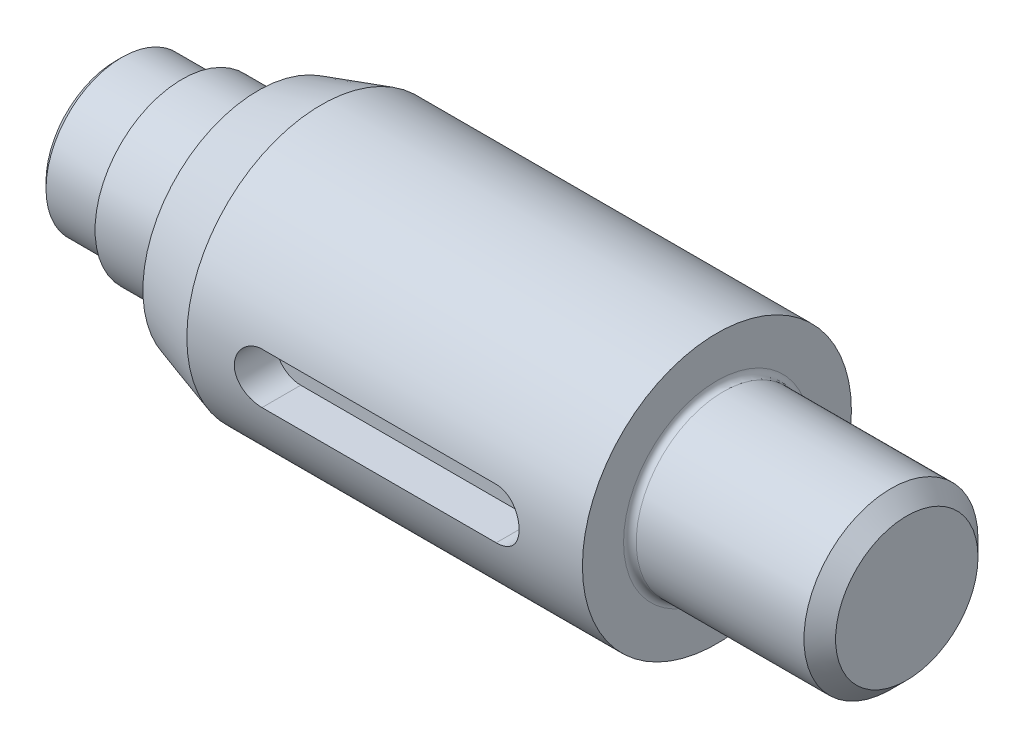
ISO-10303-21;
HEADER;
FILE_DESCRIPTION(('STEP AP214'),'2;1');
FILE_NAME('part.step','',(''),(''),'','','');
FILE_SCHEMA(('AUTOMOTIVE_DESIGN { 1 0 10303 214 1 1 1 1 }'));
ENDSEC;
DATA;
#1=APPLICATION_CONTEXT('core data for automotive mechanical design processes');
#2=APPLICATION_PROTOCOL_DEFINITION('international standard','automotive_design',2000,#1);
#3=PRODUCT_CONTEXT('',#1,'mechanical');
#4=PRODUCT('Part','Part','',(#3));
#5=PRODUCT_RELATED_PRODUCT_CATEGORY('part','',(#4));
#6=PRODUCT_DEFINITION_FORMATION('','',#4);
#7=PRODUCT_DEFINITION_CONTEXT('part definition',#1,'design');
#8=PRODUCT_DEFINITION('design','',#6,#7);
#9=PRODUCT_DEFINITION_SHAPE('','',#8);
#10=(LENGTH_UNIT() NAMED_UNIT(*) SI_UNIT(.MILLI.,.METRE.));
#11=(NAMED_UNIT(*) PLANE_ANGLE_UNIT() SI_UNIT($,.RADIAN.));
#12=(NAMED_UNIT(*) SI_UNIT($,.STERADIAN.) SOLID_ANGLE_UNIT());
#13=UNCERTAINTY_MEASURE_WITH_UNIT(LENGTH_MEASURE(1.E-05),#10,'distance_accuracy_value','');
#14=(GEOMETRIC_REPRESENTATION_CONTEXT(3) GLOBAL_UNCERTAINTY_ASSIGNED_CONTEXT((#13)) GLOBAL_UNIT_ASSIGNED_CONTEXT((#10,
#11,#12)) REPRESENTATION_CONTEXT('',''));
#15=CARTESIAN_POINT('',(0.,0.,0.));
#16=DIRECTION('',(0.,0.,1.));
#17=DIRECTION('',(1.,0.,0.));
#18=AXIS2_PLACEMENT_3D('',#15,#16,#17);
#19=CARTESIAN_POINT('',(0.,0.,0.));
#20=DIRECTION('',(1.,0.,0.));
#21=DIRECTION('',(0.,0.,-1.));
#22=AXIS2_PLACEMENT_3D('',#19,#20,#21);
#23=CYLINDRICAL_SURFACE('',#22,42.5);
#24=CARTESIAN_POINT('',(65.,0.,0.));
#25=DIRECTION('',(1.,0.,0.));
#26=DIRECTION('',(0.,0.,-1.));
#27=AXIS2_PLACEMENT_3D('',#24,#25,#26);
#28=CIRCLE('',#27,42.5);
#29=CARTESIAN_POINT('',(65.,0.,-42.5));
#30=VERTEX_POINT('',#29);
#31=EDGE_CURVE('E120',#30,#30,#28,.T.);
#32=ORIENTED_EDGE('',*,*,#31,.T.);
#33=EDGE_LOOP('',(#32));
#34=FACE_BOUND('',#33,.T.);
#35=CARTESIAN_POINT('',(190.,0.,0.));
#36=DIRECTION('',(1.,0.,0.));
#37=DIRECTION('',(0.,0.,-1.));
#38=AXIS2_PLACEMENT_3D('',#35,#36,#37);
#39=CIRCLE('',#38,42.5);
#40=CARTESIAN_POINT('',(190.,0.,-42.5));
#41=VERTEX_POINT('',#40);
#42=EDGE_CURVE('E94',#41,#41,#39,.T.);
#43=ORIENTED_EDGE('',*,*,#42,.F.);
#44=EDGE_LOOP('',(#43));
#45=FACE_BOUND('',#44,.T.);
#46=DIRECTION('',(1.,0.,0.));
#47=VECTOR('',#46,1.);
#48=CARTESIAN_POINT('',(0.,8.,41.7402683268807));
#49=LINE('',#48,#47);
#50=CARTESIAN_POINT('',(88.,8.,41.7402683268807));
#51=VERTEX_POINT('',#50);
#52=CARTESIAN_POINT('',(162.,8.,41.7402683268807));
#53=VERTEX_POINT('',#52);
#54=EDGE_CURVE('E167',#51,#53,#49,.T.);
#55=ORIENTED_EDGE('',*,*,#54,.T.);
#56=CARTESIAN_POINT('',(162.,8.,41.7402683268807));
#57=CARTESIAN_POINT('',(162.222876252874,8.00002638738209,41.7402496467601));
#58=CARTESIAN_POINT('',(162.445746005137,7.99068730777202,41.7420527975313));
#59=CARTESIAN_POINT('',(162.889851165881,7.95347087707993,41.7491672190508));
#60=CARTESIAN_POINT('',(163.111086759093,7.9255956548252,41.7544780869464));
#61=CARTESIAN_POINT('',(163.55004074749,7.85155238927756,41.7684624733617));
#62=CARTESIAN_POINT('',(163.767763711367,7.80541050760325,41.7771311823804));
#63=CARTESIAN_POINT('',(164.198473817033,7.69520108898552,41.7975721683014));
#64=CARTESIAN_POINT('',(164.411460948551,7.6311335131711,41.8093444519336));
#65=CARTESIAN_POINT('',(164.831200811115,7.48556247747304,41.8356524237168));
#66=CARTESIAN_POINT('',(165.037953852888,7.40405988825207,41.8501879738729));
#67=CARTESIAN_POINT('',(165.443892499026,7.22418907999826,41.8816120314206));
#68=CARTESIAN_POINT('',(165.643075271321,7.12581462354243,41.898501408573));
#69=CARTESIAN_POINT('',(166.032386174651,6.9129635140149,41.934145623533));
#70=CARTESIAN_POINT('',(166.222517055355,6.79849179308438,41.9528998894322));
#71=CARTESIAN_POINT('',(166.592585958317,6.55418430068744,41.9917606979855));
#72=CARTESIAN_POINT('',(166.772520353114,6.42434311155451,42.0118677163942));
#73=CARTESIAN_POINT('',(167.122841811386,6.14871592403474,42.053096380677));
#74=CARTESIAN_POINT('',(167.293102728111,6.00277087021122,42.0742267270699));
#75=CARTESIAN_POINT('',(167.620763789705,5.69712304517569,42.1167020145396));
#76=CARTESIAN_POINT('',(167.7781638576,5.53742019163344,42.1380469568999));
#77=CARTESIAN_POINT('',(168.079078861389,5.2052887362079,42.1803626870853));
#78=CARTESIAN_POINT('',(168.22258937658,5.03285611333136,42.2013333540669));
#79=CARTESIAN_POINT('',(168.494632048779,4.67653517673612,42.2423030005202));
#80=CARTESIAN_POINT('',(168.623169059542,4.49265060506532,42.2623022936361));
#81=CARTESIAN_POINT('',(168.865361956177,4.11313431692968,42.3009312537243));
#82=CARTESIAN_POINT('',(168.978892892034,3.91742160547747,42.3195489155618));
#83=CARTESIAN_POINT('',(169.189038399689,3.51693935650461,42.3547109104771));
#84=CARTESIAN_POINT('',(169.285653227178,3.31216995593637,42.3712552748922));
#85=CARTESIAN_POINT('',(169.461230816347,2.89503642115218,42.4017981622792));
#86=CARTESIAN_POINT('',(169.540195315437,2.6826730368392,42.4157969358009));
#87=CARTESIAN_POINT('',(169.679869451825,2.25186123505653,42.440849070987));
#88=CARTESIAN_POINT('',(169.740579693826,2.03341301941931,42.4519025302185));
#89=CARTESIAN_POINT('',(169.842675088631,1.59455847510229,42.470637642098));
#90=CARTESIAN_POINT('',(169.884274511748,1.37420357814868,42.4783566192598));
#91=CARTESIAN_POINT('',(169.948826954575,0.930768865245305,42.4903852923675));
#92=CARTESIAN_POINT('',(169.971786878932,0.707690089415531,42.4946962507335));
#93=CARTESIAN_POINT('',(169.998903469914,0.260323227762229,42.4997915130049));
#94=CARTESIAN_POINT('',(170.00305769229,0.0360349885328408,42.5005753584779));
#95=CARTESIAN_POINT('',(169.992522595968,-0.412081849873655,42.4985928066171));
#96=CARTESIAN_POINT('',(169.977833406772,-0.635910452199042,42.4958264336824));
#97=CARTESIAN_POINT('',(169.930039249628,-1.07861448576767,42.4868801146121));
#98=CARTESIAN_POINT('',(169.897172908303,-1.29751662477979,42.4807444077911));
#99=CARTESIAN_POINT('',(169.813434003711,-1.73181175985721,42.4652570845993));
#100=CARTESIAN_POINT('',(169.762555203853,-1.94720351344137,42.4559043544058));
#101=CARTESIAN_POINT('',(169.64319283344,-2.37285752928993,42.4342427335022));
#102=CARTESIAN_POINT('',(169.574712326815,-2.58312067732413,42.4219343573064));
#103=CARTESIAN_POINT('',(169.420651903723,-2.99711691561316,42.3946969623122));
#104=CARTESIAN_POINT('',(169.335071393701,-3.20084977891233,42.3797678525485));
#105=CARTESIAN_POINT('',(169.146903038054,-3.60153348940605,42.347604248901));
#106=CARTESIAN_POINT('',(169.044221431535,-3.79843928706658,42.3303571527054));
#107=CARTESIAN_POINT('',(168.822932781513,-4.18291611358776,42.2940953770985));
#108=CARTESIAN_POINT('',(168.704325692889,-4.37048711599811,42.2750806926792));
#109=CARTESIAN_POINT('',(168.452006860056,-4.73505590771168,42.2358007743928));
#110=CARTESIAN_POINT('',(168.318294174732,-4.91205303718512,42.2155354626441));
#111=CARTESIAN_POINT('',(168.036685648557,-5.25428718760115,42.174307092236));
#112=CARTESIAN_POINT('',(167.88878995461,-5.41952433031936,42.153344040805));
#113=CARTESIAN_POINT('',(167.577402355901,-5.73961746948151,42.1109637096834));
#114=CARTESIAN_POINT('',(167.413703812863,-5.89427225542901,42.0895444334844));
#115=CARTESIAN_POINT('',(167.073877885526,-6.18921358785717,42.0471857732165));
#116=CARTESIAN_POINT('',(166.897754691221,-6.32950493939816,42.0262462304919));
#117=CARTESIAN_POINT('',(166.534143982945,-6.59486303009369,41.9854238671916));
#118=CARTESIAN_POINT('',(166.346651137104,-6.71992254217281,41.9655415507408));
#119=CARTESIAN_POINT('',(165.961666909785,-6.95384252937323,41.9274149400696));
#120=CARTESIAN_POINT('',(165.764175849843,-7.06270352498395,41.9091705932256));
#121=CARTESIAN_POINT('',(165.360084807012,-7.26366762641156,41.8748081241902));
#122=CARTESIAN_POINT('',(165.153464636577,-7.35573101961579,41.8586950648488));
#123=CARTESIAN_POINT('',(164.733010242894,-7.52208513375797,41.8291211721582));
#124=CARTESIAN_POINT('',(164.519176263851,-7.5963764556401,41.8156602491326));
#125=CARTESIAN_POINT('',(164.086094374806,-7.72653065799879,41.7918066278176));
#126=CARTESIAN_POINT('',(163.866853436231,-7.78241605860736,41.7814101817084));
#127=CARTESIAN_POINT('',(163.424385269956,-7.87541737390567,41.763980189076));
#128=CARTESIAN_POINT('',(163.201159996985,-7.91254224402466,41.75694503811));
#129=CARTESIAN_POINT('',(162.814656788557,-7.96008886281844,41.7479029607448));
#130=CARTESIAN_POINT('',(162.651943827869,-7.97506289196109,41.745042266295));
#131=CARTESIAN_POINT('',(162.326158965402,-7.9950127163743,41.741224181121));
#132=CARTESIAN_POINT('',(162.163088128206,-8.00000529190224,41.7402635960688));
#133=CARTESIAN_POINT('',(162.,-8.,41.7402683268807));
#134=B_SPLINE_CURVE_WITH_KNOTS('',3,(#56,#57,#58,#59,#60,#61,#62,#63,#64,#65,#66,#67,#68,#69,
#70,#71,#72,#73,#74,#75,#76,#77,#78,#79,#80,#81,#82,#83,#84,#85,#86,#87,#88,#89,#90,#91,#92,#93,
#94,#95,#96,#97,#98,#99,#100,#101,#102,#103,#104,#105,#106,#107,#108,#109,#110,#111,#112,#113,
#114,#115,#116,#117,#118,#119,#120,#121,#122,#123,#124,#125,#126,#127,#128,#129,#130,#131,#132,
#133),.UNSPECIFIED.,.F.,.F.,(4,2,2,2,2,2,2,2,2,2,2,2,2,2,2,2,2,2,2,2,2,2,2,2,2,2,2,2,2,2,2,2,2,
2,2,2,2,2,4),(0.,0.668416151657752,1.33675555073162,2.00414119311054,2.67152828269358,
3.33888205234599,4.00648307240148,4.67387998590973,5.34151285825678,6.01645774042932,
6.69140666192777,7.36656970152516,8.04151327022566,8.72176362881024,9.4020037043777,
10.0821767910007,10.76232734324,11.4346538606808,12.1067312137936,12.7788959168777,
13.4510560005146,14.1145946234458,14.7783632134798,15.442016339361,16.1056925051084,
16.7731350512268,17.4405794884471,18.1080655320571,18.7755446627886,19.4533957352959,
20.1310192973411,20.8089631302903,21.4868851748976,22.1663897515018,22.8458713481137,
23.5245184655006,24.2028413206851,24.6928169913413,25.1819682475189),.UNSPECIFIED.);
#135=CARTESIAN_POINT('',(162.,-8.,41.7402683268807));
#136=VERTEX_POINT('',#135);
#137=EDGE_CURVE('E61',#53,#136,#134,.T.);
#138=ORIENTED_EDGE('',*,*,#137,.T.);
#139=DIRECTION('',(1.,0.,0.));
#140=VECTOR('',#139,1.);
#141=CARTESIAN_POINT('',(0.,-8.,41.7402683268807));
#142=LINE('',#141,#140);
#143=CARTESIAN_POINT('',(88.,-8.,41.7402683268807));
#144=VERTEX_POINT('',#143);
#145=EDGE_CURVE('E144',#136,#144,#142,.F.);
#146=ORIENTED_EDGE('',*,*,#145,.T.);
#147=CARTESIAN_POINT('',(88.,-8.,41.7402683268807));
#148=CARTESIAN_POINT('',(87.7771237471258,-8.00002638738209,41.7402496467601));
#149=CARTESIAN_POINT('',(87.5542539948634,-7.99068730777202,41.7420527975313));
#150=CARTESIAN_POINT('',(87.1101488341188,-7.95347087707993,41.7491672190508));
#151=CARTESIAN_POINT('',(86.8889132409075,-7.92559565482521,41.7544780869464));
#152=CARTESIAN_POINT('',(86.4499592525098,-7.85155238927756,41.7684624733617));
#153=CARTESIAN_POINT('',(86.2322362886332,-7.80541050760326,41.7771311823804));
#154=CARTESIAN_POINT('',(85.8015261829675,-7.69520108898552,41.7975721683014));
#155=CARTESIAN_POINT('',(85.5885390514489,-7.6311335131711,41.8093444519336));
#156=CARTESIAN_POINT('',(85.1687991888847,-7.48556247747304,41.8356524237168));
#157=CARTESIAN_POINT('',(84.9620461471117,-7.40405988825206,41.8501879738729));
#158=CARTESIAN_POINT('',(84.5561075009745,-7.22418907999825,41.8816120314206));
#159=CARTESIAN_POINT('',(84.3569247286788,-7.12581462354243,41.898501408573));
#160=CARTESIAN_POINT('',(83.9676138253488,-6.91296351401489,41.934145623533));
#161=CARTESIAN_POINT('',(83.7774829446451,-6.79849179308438,41.9528998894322));
#162=CARTESIAN_POINT('',(83.4074140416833,-6.55418430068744,41.9917606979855));
#163=CARTESIAN_POINT('',(83.2274796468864,-6.42434311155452,42.0118677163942));
#164=CARTESIAN_POINT('',(82.8771581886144,-6.14871592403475,42.053096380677));
#165=CARTESIAN_POINT('',(82.706897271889,-6.00277087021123,42.0742267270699));
#166=CARTESIAN_POINT('',(82.3792362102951,-5.6971230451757,42.1167020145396));
#167=CARTESIAN_POINT('',(82.2218361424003,-5.53742019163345,42.1380469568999));
#168=CARTESIAN_POINT('',(81.9209211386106,-5.20528873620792,42.1803626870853));
#169=CARTESIAN_POINT('',(81.77741062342,-5.03285611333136,42.2013333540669));
#170=CARTESIAN_POINT('',(81.5053679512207,-4.67653517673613,42.2423030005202));
#171=CARTESIAN_POINT('',(81.3768309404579,-4.49265060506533,42.2623022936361));
#172=CARTESIAN_POINT('',(81.1346380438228,-4.1131343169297,42.3009312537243));
#173=CARTESIAN_POINT('',(81.0211071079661,-3.91742160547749,42.3195489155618));
#174=CARTESIAN_POINT('',(80.8109616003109,-3.51693935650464,42.3547109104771));
#175=CARTESIAN_POINT('',(80.7143467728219,-3.31216995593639,42.3712552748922));
#176=CARTESIAN_POINT('',(80.5387691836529,-2.89503642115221,42.4017981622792));
#177=CARTESIAN_POINT('',(80.4598046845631,-2.68267303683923,42.4157969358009));
#178=CARTESIAN_POINT('',(80.3201305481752,-2.25186123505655,42.440849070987));
#179=CARTESIAN_POINT('',(80.2594203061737,-2.03341301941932,42.4519025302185));
#180=CARTESIAN_POINT('',(80.157324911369,-1.5945584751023,42.470637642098));
#181=CARTESIAN_POINT('',(80.1157254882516,-1.3742035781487,42.4783566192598));
#182=CARTESIAN_POINT('',(80.0511730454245,-0.930768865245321,42.4903852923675));
#183=CARTESIAN_POINT('',(80.028213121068,-0.707690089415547,42.4946962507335));
#184=CARTESIAN_POINT('',(80.0010965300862,-0.260323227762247,42.4997915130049));
#185=CARTESIAN_POINT('',(79.9969423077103,-0.0360349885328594,42.5005753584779));
#186=CARTESIAN_POINT('',(80.0074774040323,0.412081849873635,42.4985928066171));
#187=CARTESIAN_POINT('',(80.0221665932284,0.635910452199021,42.4958264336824));
#188=CARTESIAN_POINT('',(80.0699607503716,1.07861448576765,42.4868801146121));
#189=CARTESIAN_POINT('',(80.1028270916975,1.29751662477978,42.4807444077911));
#190=CARTESIAN_POINT('',(80.1865659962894,1.73181175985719,42.4652570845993));
#191=CARTESIAN_POINT('',(80.2374447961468,1.94720351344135,42.4559043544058));
#192=CARTESIAN_POINT('',(80.3568071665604,2.37285752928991,42.4342427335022));
#193=CARTESIAN_POINT('',(80.4252876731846,2.58312067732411,42.4219343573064));
#194=CARTESIAN_POINT('',(80.5793480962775,2.99711691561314,42.3946969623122));
#195=CARTESIAN_POINT('',(80.6649286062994,3.20084977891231,42.3797678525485));
#196=CARTESIAN_POINT('',(80.8530969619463,3.60153348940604,42.347604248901));
#197=CARTESIAN_POINT('',(80.9557785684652,3.79843928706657,42.3303571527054));
#198=CARTESIAN_POINT('',(81.1770672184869,4.18291611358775,42.2940953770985));
#199=CARTESIAN_POINT('',(81.2956743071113,4.3704871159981,42.2750806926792));
#200=CARTESIAN_POINT('',(81.5479931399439,4.73505590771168,42.2358007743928));
#201=CARTESIAN_POINT('',(81.6817058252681,4.91205303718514,42.2155354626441));
#202=CARTESIAN_POINT('',(81.963314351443,5.25428718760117,42.174307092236));
#203=CARTESIAN_POINT('',(82.1112100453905,5.41952433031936,42.153344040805));
#204=CARTESIAN_POINT('',(82.4225976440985,5.7396174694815,42.1109637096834));
#205=CARTESIAN_POINT('',(82.5862961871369,5.894272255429,42.0895444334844));
#206=CARTESIAN_POINT('',(82.9261221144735,6.18921358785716,42.0471857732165));
#207=CARTESIAN_POINT('',(83.1022453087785,6.32950493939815,42.0262462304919));
#208=CARTESIAN_POINT('',(83.4658560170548,6.59486303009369,41.9854238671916));
#209=CARTESIAN_POINT('',(83.6533488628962,6.71992254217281,41.9655415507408));
#210=CARTESIAN_POINT('',(84.038333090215,6.95384252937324,41.9274149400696));
#211=CARTESIAN_POINT('',(84.2358241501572,7.06270352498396,41.9091705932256));
#212=CARTESIAN_POINT('',(84.6399151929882,7.26366762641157,41.8748081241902));
#213=CARTESIAN_POINT('',(84.8465353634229,7.35573101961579,41.8586950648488));
#214=CARTESIAN_POINT('',(85.2669897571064,7.52208513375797,41.8291211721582));
#215=CARTESIAN_POINT('',(85.4808237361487,7.5963764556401,41.8156602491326));
#216=CARTESIAN_POINT('',(85.9139056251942,7.72653065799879,41.7918066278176));
#217=CARTESIAN_POINT('',(86.1331465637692,7.78241605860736,41.7814101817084));
#218=CARTESIAN_POINT('',(86.5756147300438,7.87541737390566,41.763980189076));
#219=CARTESIAN_POINT('',(86.7988400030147,7.91254224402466,41.75694503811));
#220=CARTESIAN_POINT('',(87.1853432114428,7.96008886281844,41.7479029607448));
#221=CARTESIAN_POINT('',(87.3480561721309,7.97506289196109,41.745042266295));
#222=CARTESIAN_POINT('',(87.6738410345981,7.9950127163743,41.741224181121));
#223=CARTESIAN_POINT('',(87.8369118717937,8.00000529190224,41.7402635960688));
#224=CARTESIAN_POINT('',(88.,8.,41.7402683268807));
#225=B_SPLINE_CURVE_WITH_KNOTS('',3,(#147,#148,#149,#150,#151,#152,#153,#154,#155,#156,#157,
#158,#159,#160,#161,#162,#163,#164,#165,#166,#167,#168,#169,#170,#171,#172,#173,#174,#175,#176,
#177,#178,#179,#180,#181,#182,#183,#184,#185,#186,#187,#188,#189,#190,#191,#192,#193,#194,#195,
#196,#197,#198,#199,#200,#201,#202,#203,#204,#205,#206,#207,#208,#209,#210,#211,#212,#213,#214,
#215,#216,#217,#218,#219,#220,#221,#222,#223,#224),.UNSPECIFIED.,.F.,.F.,(4,2,2,2,2,2,2,2,2,2,2,
2,2,2,2,2,2,2,2,2,2,2,2,2,2,2,2,2,2,2,2,2,2,2,2,2,2,2,4),(0.,0.668416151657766,1.33675555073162,
2.00414119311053,2.67152828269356,3.33888205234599,4.00648307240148,4.67387998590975,
5.34151285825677,6.01645774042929,6.69140666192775,7.36656970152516,8.04151327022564,
8.72176362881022,9.40200370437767,10.0821767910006,10.76232734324,11.4346538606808,
12.1067312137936,12.7788959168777,13.4510560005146,14.1145946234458,14.7783632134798,
15.442016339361,16.1056925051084,16.7731350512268,17.4405794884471,18.1080655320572,
18.7755446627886,19.4533957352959,20.1310192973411,20.8089631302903,21.4868851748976,
22.1663897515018,22.8458713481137,23.5245184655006,24.2028413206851,24.6928169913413,
25.181968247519),.UNSPECIFIED.);
#226=EDGE_CURVE('E69',#144,#51,#225,.T.);
#227=ORIENTED_EDGE('',*,*,#226,.T.);
#228=EDGE_LOOP('',(#55,#138,#146,#227));
#229=FACE_BOUND('',#228,.T.);
#230=ADVANCED_FACE('F46',(#34,#45,#229),#23,.T.);
#231=CARTESIAN_POINT('',(0.,0.,0.));
#232=DIRECTION('',(-1.,0.,0.));
#233=DIRECTION('',(0.,0.,1.));
#234=AXIS2_PLACEMENT_3D('',#231,#232,#233);
#235=PLANE('',#234);
#236=CARTESIAN_POINT('',(0.,0.,0.));
#237=DIRECTION('',(-1.,0.,0.));
#238=DIRECTION('',(0.,0.,1.));
#239=AXIS2_PLACEMENT_3D('',#236,#237,#238);
#240=CIRCLE('',#239,22.);
#241=CARTESIAN_POINT('',(0.,0.,22.));
#242=VERTEX_POINT('',#241);
#243=EDGE_CURVE('E173',#242,#242,#240,.T.);
#244=ORIENTED_EDGE('',*,*,#243,.T.);
#245=EDGE_LOOP('',(#244));
#246=FACE_BOUND('',#245,.T.);
#247=ADVANCED_FACE('F203',(#246),#235,.T.);
#248=CARTESIAN_POINT('',(0.,0.,0.));
#249=DIRECTION('',(1.,0.,0.));
#250=DIRECTION('',(0.,0.,-1.));
#251=AXIS2_PLACEMENT_3D('',#248,#249,#250);
#252=CYLINDRICAL_SURFACE('',#251,24.);
#253=CARTESIAN_POINT('',(2.00000000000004,0.,0.));
#254=DIRECTION('',(-1.,0.,0.));
#255=DIRECTION('',(0.,0.,1.));
#256=AXIS2_PLACEMENT_3D('',#253,#254,#255);
#257=CIRCLE('',#256,24.);
#258=CARTESIAN_POINT('',(2.00000000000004,0.,24.));
#259=VERTEX_POINT('',#258);
#260=EDGE_CURVE('E170',#259,#259,#257,.F.);
#261=ORIENTED_EDGE('',*,*,#260,.T.);
#262=EDGE_LOOP('',(#261));
#263=FACE_BOUND('',#262,.T.);
#264=CARTESIAN_POINT('',(19.,0.,0.));
#265=DIRECTION('',(1.,0.,0.));
#266=DIRECTION('',(0.,0.,-1.));
#267=AXIS2_PLACEMENT_3D('',#264,#265,#266);
#268=CIRCLE('',#267,24.);
#269=CARTESIAN_POINT('',(19.,0.,-24.));
#270=VERTEX_POINT('',#269);
#271=EDGE_CURVE('E135',#270,#270,#268,.T.);
#272=ORIENTED_EDGE('',*,*,#271,.F.);
#273=EDGE_LOOP('',(#272));
#274=FACE_BOUND('',#273,.T.);
#275=ADVANCED_FACE('F208',(#263,#274),#252,.T.);
#276=CARTESIAN_POINT('',(19.,24.,0.));
#277=DIRECTION('',(1.,0.,0.));
#278=DIRECTION('',(0.,0.,-1.));
#279=AXIS2_PLACEMENT_3D('',#276,#277,#278);
#280=PLANE('',#279);
#281=ORIENTED_EDGE('',*,*,#271,.T.);
#282=EDGE_LOOP('',(#281));
#283=FACE_BOUND('',#282,.T.);
#284=CARTESIAN_POINT('',(19.,0.,0.));
#285=DIRECTION('',(1.,0.,0.));
#286=DIRECTION('',(0.,0.,-1.));
#287=AXIS2_PLACEMENT_3D('',#284,#285,#286);
#288=CIRCLE('',#287,20.);
#289=CARTESIAN_POINT('',(19.,0.,-20.));
#290=VERTEX_POINT('',#289);
#291=EDGE_CURVE('E132',#290,#290,#288,.T.);
#292=ORIENTED_EDGE('',*,*,#291,.F.);
#293=EDGE_LOOP('',(#292));
#294=FACE_BOUND('',#293,.T.);
#295=ADVANCED_FACE('F236',(#283,#294),#280,.T.);
#296=CARTESIAN_POINT('',(0.,0.,0.));
#297=DIRECTION('',(1.,0.,0.));
#298=DIRECTION('',(0.,0.,-1.));
#299=AXIS2_PLACEMENT_3D('',#296,#297,#298);
#300=CYLINDRICAL_SURFACE('',#299,20.);
#301=ORIENTED_EDGE('',*,*,#291,.T.);
#302=EDGE_LOOP('',(#301));
#303=FACE_BOUND('',#302,.T.);
#304=CARTESIAN_POINT('',(21.,0.,0.));
#305=DIRECTION('',(1.,0.,0.));
#306=DIRECTION('',(0.,0.,-1.));
#307=AXIS2_PLACEMENT_3D('',#304,#305,#306);
#308=CIRCLE('',#307,20.);
#309=CARTESIAN_POINT('',(21.,0.,-20.));
#310=VERTEX_POINT('',#309);
#311=EDGE_CURVE('E129',#310,#310,#308,.T.);
#312=ORIENTED_EDGE('',*,*,#311,.F.);
#313=EDGE_LOOP('',(#312));
#314=FACE_BOUND('',#313,.T.);
#315=ADVANCED_FACE('F240',(#303,#314),#300,.T.);
#316=CARTESIAN_POINT('',(21.,20.,0.));
#317=DIRECTION('',(-1.,0.,0.));
#318=DIRECTION('',(0.,0.,1.));
#319=AXIS2_PLACEMENT_3D('',#316,#317,#318);
#320=PLANE('',#319);
#321=ORIENTED_EDGE('',*,*,#311,.T.);
#322=EDGE_LOOP('',(#321));
#323=FACE_BOUND('',#322,.T.);
#324=CARTESIAN_POINT('',(21.,0.,0.));
#325=DIRECTION('',(1.,0.,0.));
#326=DIRECTION('',(0.,0.,-1.));
#327=AXIS2_PLACEMENT_3D('',#324,#325,#326);
#328=CIRCLE('',#327,27.5);
#329=CARTESIAN_POINT('',(21.,0.,-27.5));
#330=VERTEX_POINT('',#329);
#331=EDGE_CURVE('E126',#330,#330,#328,.T.);
#332=ORIENTED_EDGE('',*,*,#331,.F.);
#333=EDGE_LOOP('',(#332));
#334=FACE_BOUND('',#333,.T.);
#335=ADVANCED_FACE('F244',(#323,#334),#320,.T.);
#336=CARTESIAN_POINT('',(0.,0.,0.));
#337=DIRECTION('',(1.,0.,0.));
#338=DIRECTION('',(0.,0.,-1.));
#339=AXIS2_PLACEMENT_3D('',#336,#337,#338);
#340=CYLINDRICAL_SURFACE('',#339,27.5);
#341=CARTESIAN_POINT('',(42.,0.,0.));
#342=DIRECTION('',(-1.,0.,0.));
#343=DIRECTION('',(0.,0.,1.));
#344=AXIS2_PLACEMENT_3D('',#341,#342,#343);
#345=CIRCLE('',#344,27.5);
#346=CARTESIAN_POINT('',(42.,0.,27.5));
#347=VERTEX_POINT('',#346);
#348=EDGE_CURVE('E13',#347,#347,#345,.T.);
#349=ORIENTED_EDGE('',*,*,#348,.T.);
#350=EDGE_LOOP('',(#349));
#351=FACE_BOUND('',#350,.T.);
#352=ORIENTED_EDGE('',*,*,#331,.T.);
#353=EDGE_LOOP('',(#352));
#354=FACE_BOUND('',#353,.T.);
#355=ADVANCED_FACE('F248',(#351,#354),#340,.T.);
#356=CARTESIAN_POINT('',(45.,27.5,0.));
#357=DIRECTION('',(-1.,0.,0.));
#358=DIRECTION('',(0.,0.,1.));
#359=AXIS2_PLACEMENT_3D('',#356,#357,#358);
#360=PLANE('',#359);
#361=CARTESIAN_POINT('',(45.,0.,0.));
#362=DIRECTION('',(-1.,0.,0.));
#363=DIRECTION('',(0.,0.,1.));
#364=AXIS2_PLACEMENT_3D('',#361,#362,#363);
#365=CIRCLE('',#364,30.5);
#366=CARTESIAN_POINT('',(45.,0.,30.5));
#367=VERTEX_POINT('',#366);
#368=EDGE_CURVE('E54',#367,#367,#365,.F.);
#369=ORIENTED_EDGE('',*,*,#368,.T.);
#370=EDGE_LOOP('',(#369));
#371=FACE_BOUND('',#370,.T.);
#372=CARTESIAN_POINT('',(45.,0.,0.));
#373=DIRECTION('',(1.,0.,0.));
#374=DIRECTION('',(0.,0.,-1.));
#375=AXIS2_PLACEMENT_3D('',#372,#373,#374);
#376=CIRCLE('',#375,36.3853863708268);
#377=CARTESIAN_POINT('',(45.,0.,-36.3853863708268));
#378=VERTEX_POINT('',#377);
#379=EDGE_CURVE('E123',#378,#378,#376,.T.);
#380=ORIENTED_EDGE('',*,*,#379,.F.);
#381=EDGE_LOOP('',(#380));
#382=FACE_BOUND('',#381,.T.);
#383=ADVANCED_FACE('F190',(#371,#382),#360,.T.);
#384=CARTESIAN_POINT('',(65.,0.,0.));
#385=DIRECTION('',(1.,0.,0.));
#386=DIRECTION('',(0.,0.,-1.));
#387=AXIS2_PLACEMENT_3D('',#384,#385,#386);
#388=CONICAL_SURFACE('',#387,42.5,0.296705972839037);
#389=ORIENTED_EDGE('',*,*,#379,.T.);
#390=EDGE_LOOP('',(#389));
#391=FACE_BOUND('',#390,.T.);
#392=ORIENTED_EDGE('',*,*,#31,.F.);
#393=EDGE_LOOP('',(#392));
#394=FACE_BOUND('',#393,.T.);
#395=ADVANCED_FACE('F254',(#391,#394),#388,.T.);
#396=CARTESIAN_POINT('',(190.,42.5,0.));
#397=DIRECTION('',(1.,0.,0.));
#398=DIRECTION('',(0.,0.,-1.));
#399=AXIS2_PLACEMENT_3D('',#396,#397,#398);
#400=PLANE('',#399);
#401=CARTESIAN_POINT('',(190.,0.,0.));
#402=DIRECTION('',(1.,0.,0.));
#403=DIRECTION('',(0.,0.,-1.));
#404=AXIS2_PLACEMENT_3D('',#401,#402,#403);
#405=CIRCLE('',#404,29.5);
#406=CARTESIAN_POINT('',(190.,0.,-29.5));
#407=VERTEX_POINT('',#406);
#408=EDGE_CURVE('E185',#407,#407,#405,.F.);
#409=ORIENTED_EDGE('',*,*,#408,.T.);
#410=EDGE_LOOP('',(#409));
#411=FACE_BOUND('',#410,.T.);
#412=ORIENTED_EDGE('',*,*,#42,.T.);
#413=EDGE_LOOP('',(#412));
#414=FACE_BOUND('',#413,.T.);
#415=ADVANCED_FACE('F256',(#411,#414),#400,.T.);
#416=CARTESIAN_POINT('',(0.,0.,0.));
#417=DIRECTION('',(1.,0.,0.));
#418=DIRECTION('',(0.,0.,-1.));
#419=AXIS2_PLACEMENT_3D('',#416,#417,#418);
#420=CYLINDRICAL_SURFACE('',#419,27.5);
#421=CARTESIAN_POINT('',(192.,0.,0.));
#422=DIRECTION('',(1.,0.,0.));
#423=DIRECTION('',(0.,0.,-1.));
#424=AXIS2_PLACEMENT_3D('',#421,#422,#423);
#425=CIRCLE('',#424,27.5);
#426=CARTESIAN_POINT('',(192.,0.,-27.5));
#427=VERTEX_POINT('',#426);
#428=EDGE_CURVE('E182',#427,#427,#425,.T.);
#429=ORIENTED_EDGE('',*,*,#428,.T.);
#430=EDGE_LOOP('',(#429));
#431=FACE_BOUND('',#430,.T.);
#432=CARTESIAN_POINT('',(245.,0.,0.));
#433=DIRECTION('',(1.,0.,0.));
#434=DIRECTION('',(0.,0.,-1.));
#435=AXIS2_PLACEMENT_3D('',#432,#433,#434);
#436=CIRCLE('',#435,27.5);
#437=CARTESIAN_POINT('',(245.,0.,-27.5));
#438=VERTEX_POINT('',#437);
#439=EDGE_CURVE('E179',#438,#438,#436,.F.);
#440=ORIENTED_EDGE('',*,*,#439,.T.);
#441=EDGE_LOOP('',(#440));
#442=FACE_BOUND('',#441,.T.);
#443=ADVANCED_FACE('F261',(#431,#442),#420,.T.);
#444=CARTESIAN_POINT('',(250.,27.5,0.));
#445=DIRECTION('',(1.,0.,0.));
#446=DIRECTION('',(0.,0.,-1.));
#447=AXIS2_PLACEMENT_3D('',#444,#445,#446);
#448=PLANE('',#447);
#449=CARTESIAN_POINT('',(250.,0.,0.));
#450=DIRECTION('',(1.,0.,0.));
#451=DIRECTION('',(0.,0.,-1.));
#452=AXIS2_PLACEMENT_3D('',#449,#450,#451);
#453=CIRCLE('',#452,22.5);
#454=CARTESIAN_POINT('',(250.,0.,-22.5));
#455=VERTEX_POINT('',#454);
#456=EDGE_CURVE('E176',#455,#455,#453,.T.);
#457=ORIENTED_EDGE('',*,*,#456,.T.);
#458=EDGE_LOOP('',(#457));
#459=FACE_BOUND('',#458,.T.);
#460=ADVANCED_FACE('F161',(#459),#448,.T.);
#461=CARTESIAN_POINT('',(88.,0.,42.5));
#462=DIRECTION('',(0.,0.,-1.));
#463=DIRECTION('',(-1.,0.,0.));
#464=AXIS2_PLACEMENT_3D('',#461,#462,#463);
#465=CYLINDRICAL_SURFACE('',#464,8.);
#466=DIRECTION('',(0.,0.,-1.));
#467=VECTOR('',#466,1.);
#468=CARTESIAN_POINT('',(88.,-8.,42.5));
#469=LINE('',#468,#467);
#470=CARTESIAN_POINT('',(88.,-8.,29.5));
#471=VERTEX_POINT('',#470);
#472=EDGE_CURVE('E87',#144,#471,#469,.T.);
#473=ORIENTED_EDGE('',*,*,#472,.T.);
#474=CARTESIAN_POINT('',(88.,0.,29.5));
#475=DIRECTION('',(0.,0.,1.));
#476=DIRECTION('',(1.,0.,0.));
#477=AXIS2_PLACEMENT_3D('',#474,#475,#476);
#478=CIRCLE('',#477,8.);
#479=CARTESIAN_POINT('',(88.,8.,29.5));
#480=VERTEX_POINT('',#479);
#481=EDGE_CURVE('E91',#480,#471,#478,.T.);
#482=ORIENTED_EDGE('',*,*,#481,.F.);
#483=DIRECTION('',(0.,0.,-1.));
#484=VECTOR('',#483,1.);
#485=CARTESIAN_POINT('',(88.,8.,42.5));
#486=LINE('',#485,#484);
#487=EDGE_CURVE('E113',#51,#480,#486,.T.);
#488=ORIENTED_EDGE('',*,*,#487,.F.);
#489=ORIENTED_EDGE('',*,*,#226,.F.);
#490=EDGE_LOOP('',(#473,#482,#488,#489));
#491=FACE_BOUND('',#490,.T.);
#492=ADVANCED_FACE('F89',(#491),#465,.F.);
#493=CARTESIAN_POINT('',(88.,-8.,42.5));
#494=DIRECTION('',(0.,1.,0.));
#495=DIRECTION('',(0.,0.,1.));
#496=AXIS2_PLACEMENT_3D('',#493,#494,#495);
#497=PLANE('',#496);
#498=DIRECTION('',(0.,0.,-1.));
#499=VECTOR('',#498,1.);
#500=CARTESIAN_POINT('',(162.,-8.,42.5));
#501=LINE('',#500,#499);
#502=CARTESIAN_POINT('',(162.,-8.,29.5));
#503=VERTEX_POINT('',#502);
#504=EDGE_CURVE('E95',#136,#503,#501,.T.);
#505=ORIENTED_EDGE('',*,*,#504,.T.);
#506=DIRECTION('',(1.,0.,0.));
#507=VECTOR('',#506,1.);
#508=CARTESIAN_POINT('',(88.,-8.,29.5));
#509=LINE('',#508,#507);
#510=EDGE_CURVE('E98',#471,#503,#509,.T.);
#511=ORIENTED_EDGE('',*,*,#510,.F.);
#512=ORIENTED_EDGE('',*,*,#472,.F.);
#513=ORIENTED_EDGE('',*,*,#145,.F.);
#514=EDGE_LOOP('',(#505,#511,#512,#513));
#515=FACE_BOUND('',#514,.T.);
#516=ADVANCED_FACE('F99',(#515),#497,.T.);
#517=CARTESIAN_POINT('',(162.,0.,42.5));
#518=DIRECTION('',(0.,0.,-1.));
#519=DIRECTION('',(-1.,0.,0.));
#520=AXIS2_PLACEMENT_3D('',#517,#518,#519);
#521=CYLINDRICAL_SURFACE('',#520,8.);
#522=DIRECTION('',(0.,0.,-1.));
#523=VECTOR('',#522,1.);
#524=CARTESIAN_POINT('',(162.,8.,42.5));
#525=LINE('',#524,#523);
#526=CARTESIAN_POINT('',(162.,8.,29.5));
#527=VERTEX_POINT('',#526);
#528=EDGE_CURVE('E115',#53,#527,#525,.T.);
#529=ORIENTED_EDGE('',*,*,#528,.T.);
#530=CARTESIAN_POINT('',(162.,0.,29.5));
#531=DIRECTION('',(0.,0.,1.));
#532=DIRECTION('',(1.,0.,0.));
#533=AXIS2_PLACEMENT_3D('',#530,#531,#532);
#534=CIRCLE('',#533,8.);
#535=EDGE_CURVE('E103',#503,#527,#534,.T.);
#536=ORIENTED_EDGE('',*,*,#535,.F.);
#537=ORIENTED_EDGE('',*,*,#504,.F.);
#538=ORIENTED_EDGE('',*,*,#137,.F.);
#539=EDGE_LOOP('',(#529,#536,#537,#538));
#540=FACE_BOUND('',#539,.T.);
#541=ADVANCED_FACE('F149',(#540),#521,.F.);
#542=CARTESIAN_POINT('',(88.,8.,42.5));
#543=DIRECTION('',(0.,-1.,0.));
#544=DIRECTION('',(0.,0.,-1.));
#545=AXIS2_PLACEMENT_3D('',#542,#543,#544);
#546=PLANE('',#545);
#547=ORIENTED_EDGE('',*,*,#487,.T.);
#548=DIRECTION('',(-1.,0.,0.));
#549=VECTOR('',#548,1.);
#550=CARTESIAN_POINT('',(88.,8.,29.5));
#551=LINE('',#550,#549);
#552=EDGE_CURVE('E108',#527,#480,#551,.T.);
#553=ORIENTED_EDGE('',*,*,#552,.F.);
#554=ORIENTED_EDGE('',*,*,#528,.F.);
#555=ORIENTED_EDGE('',*,*,#54,.F.);
#556=EDGE_LOOP('',(#547,#553,#554,#555));
#557=FACE_BOUND('',#556,.T.);
#558=ADVANCED_FACE('F154',(#557),#546,.T.);
#559=CARTESIAN_POINT('',(88.,0.,29.5));
#560=DIRECTION('',(0.,0.,1.));
#561=DIRECTION('',(1.,0.,0.));
#562=AXIS2_PLACEMENT_3D('',#559,#560,#561);
#563=PLANE('',#562);
#564=ORIENTED_EDGE('',*,*,#481,.T.);
#565=ORIENTED_EDGE('',*,*,#510,.T.);
#566=ORIENTED_EDGE('',*,*,#535,.T.);
#567=ORIENTED_EDGE('',*,*,#552,.T.);
#568=EDGE_LOOP('',(#564,#565,#566,#567));
#569=FACE_BOUND('',#568,.T.);
#570=ADVANCED_FACE('F106',(#569),#563,.T.);
#571=CARTESIAN_POINT('',(2.00000000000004,0.,0.));
#572=DIRECTION('',(1.,0.,0.));
#573=DIRECTION('',(0.,0.,-1.));
#574=AXIS2_PLACEMENT_3D('',#571,#572,#573);
#575=CONICAL_SURFACE('',#574,24.,0.785398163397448);
#576=ORIENTED_EDGE('',*,*,#243,.F.);
#577=EDGE_LOOP('',(#576));
#578=FACE_BOUND('',#577,.T.);
#579=ORIENTED_EDGE('',*,*,#260,.F.);
#580=EDGE_LOOP('',(#579));
#581=FACE_BOUND('',#580,.T.);
#582=ADVANCED_FACE('F220',(#578,#581),#575,.T.);
#583=CARTESIAN_POINT('',(250.,0.,0.));
#584=DIRECTION('',(-1.,0.,0.));
#585=DIRECTION('',(0.,0.,1.));
#586=AXIS2_PLACEMENT_3D('',#583,#584,#585);
#587=CONICAL_SURFACE('',#586,22.5,0.785398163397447);
#588=ORIENTED_EDGE('',*,*,#439,.F.);
#589=EDGE_LOOP('',(#588));
#590=FACE_BOUND('',#589,.T.);
#591=ORIENTED_EDGE('',*,*,#456,.F.);
#592=EDGE_LOOP('',(#591));
#593=FACE_BOUND('',#592,.T.);
#594=ADVANCED_FACE('F199',(#590,#593),#587,.T.);
#595=CARTESIAN_POINT('',(192.,0.,0.));
#596=DIRECTION('',(1.,0.,0.));
#597=DIRECTION('',(0.,0.,-1.));
#598=AXIS2_PLACEMENT_3D('',#595,#596,#597);
#599=TOROIDAL_SURFACE('',#598,29.5,2.);
#600=ORIENTED_EDGE('',*,*,#408,.F.);
#601=EDGE_LOOP('',(#600));
#602=FACE_BOUND('',#601,.T.);
#603=ORIENTED_EDGE('',*,*,#428,.F.);
#604=EDGE_LOOP('',(#603));
#605=FACE_BOUND('',#604,.T.);
#606=ADVANCED_FACE('F194',(#602,#605),#599,.F.);
#607=CARTESIAN_POINT('',(42.,0.,0.));
#608=DIRECTION('',(-1.,0.,0.));
#609=DIRECTION('',(0.,0.,1.));
#610=AXIS2_PLACEMENT_3D('',#607,#608,#609);
#611=TOROIDAL_SURFACE('',#610,30.5,3.);
#612=ORIENTED_EDGE('',*,*,#348,.F.);
#613=EDGE_LOOP('',(#612));
#614=FACE_BOUND('',#613,.T.);
#615=ORIENTED_EDGE('',*,*,#368,.F.);
#616=EDGE_LOOP('',(#615));
#617=FACE_BOUND('',#616,.T.);
#618=ADVANCED_FACE('F48',(#614,#617),#611,.F.);
#619=CLOSED_SHELL('',(#230,#247,#275,#295,#315,#335,#355,#383,#395,#415,#443,#460,#492,#516,
#541,#558,#570,#582,#594,#606,#618));
#620=MANIFOLD_SOLID_BREP('B2',#619);
#621=ADVANCED_BREP_SHAPE_REPRESENTATION('',(#18,#620),#14);
#622=SHAPE_DEFINITION_REPRESENTATION(#9,#621);
ENDSEC;
END-ISO-10303-21;
